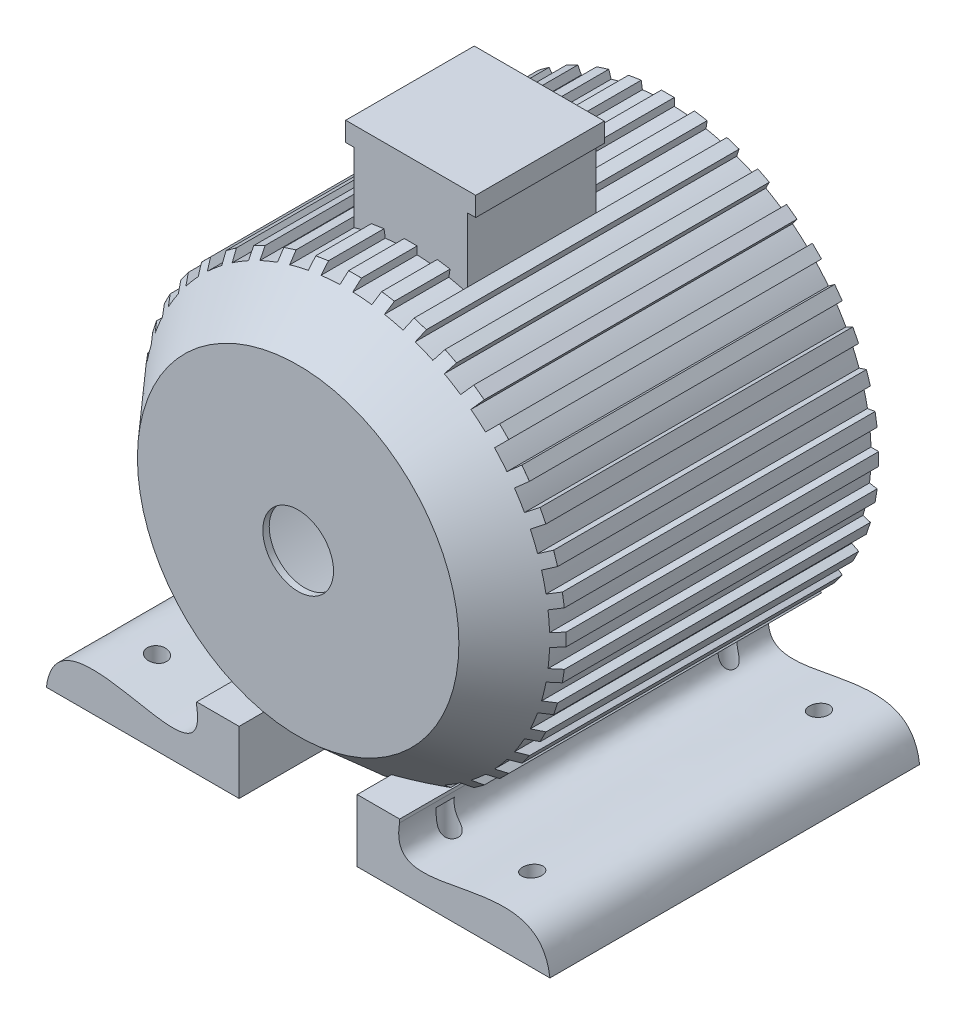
from build123d import *

# Parameters (mm, degrees)
SKETCH2_R           = 55
CUT_EXTRUDE1_DEPTH  = 934
BOSS_EXTRUDE1_DEPTH = 10
BOSS_EXTRUDE2_REACH = 734.755
CIRPATTERN3_COUNT   = 40
BOSS_EXTRUDE5_REACH = 740.81
SKETCH9_R           = 15
CUT_EXTRUDE3_DEPTH  = 83
BOSS_EXTRUDE6_DEPTH = 200


with BuildPart() as part:
    # Sketch1 → Revolve1 (revolve)
    with BuildSketch(Plane(origin=(0, 0, 0), x_dir=(1, 0, 0), z_dir=(0, 1, 0))):
        Polygon((0, 0), (250, 0), (316.097841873, 75.040491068), (316.097841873, 575.040491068), (306.097841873, 575.040491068), (306.097841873, 78.816636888), (245.48215135, 10), (0, 10), align=None)
    revolve(axis=Axis((0, 0, 0), (0, 0, -1)))

    # Sketch2 → Cut-Extrude1 (cut)
    with BuildSketch(Plane.XY):
        Circle(SKETCH2_R)
    extrude(amount=-CUT_EXTRUDE1_DEPTH, mode=Mode.SUBTRACT)

    # Boss-Extrude2: up to this face of the body (flat: up to its plane)
    boss_extrude2_end = Plane(part.part.faces().sort_by_distance((-307.157244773, 0, -575.040491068))[0])
    # Sketch4 → Boss-Extrude2 (add, up to the picked face)
    with BuildSketch(Plane.XY, mode=Mode.PRIVATE) as boss_extrude2_sk1:
        with BuildLine():
            Line((328, 10), (328, -10))
            Line((328, -10), (315.939623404, -10))
            ThreePointArc((315.939623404, -10), (316.097841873, 0), (315.939623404, 10))
            Line((315.939623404, 10), (328, 10))
        make_face()
    boss_extrude2_tool1 = split(extrude(boss_extrude2_sk1.sketch, amount=-BOSS_EXTRUDE2_REACH, mode=Mode.PRIVATE), bisect_by=boss_extrude2_end, keep=Keep.BOTH, mode=Mode.PRIVATE)
    boss_extrude2 = boss_extrude2_tool1.solids().sort_by(Axis((322.022461, 0, 0), (0, 0, -1)))[0]
    add(boss_extrude2)

    # CirPattern3: Boss-Extrude2 ×40 about axis
    cirpattern3_axis = Axis((0, 0, 0), (0, 0, 1))
    for i in range(1, CIRPATTERN3_COUNT):
        add(boss_extrude2.rotate(cirpattern3_axis, i * 360 / CIRPATTERN3_COUNT))


with BuildPart() as body_2:
    # Sketch3 → Boss-Extrude1 (new body)
    with BuildSketch(Plane(origin=(0, 0, 0), x_dir=(1, 0, 0), z_dir=(0, 1, 0))):
        Polygon((-316.097841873, 575.040491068), (-326.097841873, 575.040491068), (-326.097841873, 75.040491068), (-259.128300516, 0), (-250, 0), (-316.097841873, 75.040491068), align=None)
    extrude(amount=BOSS_EXTRUDE1_DEPTH)


with BuildPart() as cut_revolve3_tool:
    # Sketch5 → Cut-Revolve3 (revolve)
    with BuildSketch(Plane(origin=(0, 0, 0), x_dir=(1, 0, 0), z_dir=(0, 1, 0))):
        Polygon((250, 0), (328, 88.552941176), (372.397114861, 88.552941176), (372.397114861, -23.891672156), (250, -35.784369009), align=None)
    revolve(axis=Axis((0, 0, 0), (0, 0, -1)))


with BuildPart() as part_1:
    add(part.part)

    # Cut-Revolve3: cut by cut_revolve3_tool
    add(cut_revolve3_tool.part, mode=Mode.SUBTRACT)

    # Boss-Extrude5: up to this face of the body (flat: up to its plane)
    boss_extrude5_end = Plane(part_1.part.faces().sort_by_distance((321.969811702, -0.722759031, -575.040491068))[0])
    # Sketch8 → Boss-Extrude5 (add, up to the picked face)
    with BuildSketch(Plane.XY, mode=Mode.PRIVATE) as boss_extrude5_sk1:
        with BuildLine():
            Line((91.847008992, -315.036707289), (91.847008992, -379.791815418))
            Line((91.847008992, -379.791815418), (391.638752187, -379.791815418))
            add(Edge.make_bspline(
                [(157.818949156, -287.710234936), (136.098941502, -414.277923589), (372.783888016, -235.115469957), (391.638752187, -379.791815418)],
                knots=[0, 0, 0, 0, 1, 1, 1, 1], degree=3))
            Line((157.818949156, -287.710234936), (157.818949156, -282.562965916))
            Line((157.818949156, -282.562965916), (91.847008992, -282.562965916))
            Line((91.847008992, -282.562965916), (91.847008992, -315.036707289))
        make_face()
    boss_extrude5_tool1 = split(extrude(boss_extrude5_sk1.sketch, amount=-BOSS_EXTRUDE5_REACH, mode=Mode.PRIVATE), bisect_by=boss_extrude5_end, keep=Keep.BOTH, mode=Mode.PRIVATE)
    # Sketch8 → Boss-Extrude5 (add, up to the picked face)
    with BuildSketch(Plane.XY, mode=Mode.PRIVATE) as boss_extrude5_sk2:
        with BuildLine():
            Line((-91.847008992, -282.562965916), (-157.818949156, -282.562965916))
            Line((-157.818949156, -282.562965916), (-157.818949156, -287.710234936))
            add(Edge.make_bspline(
                [(-157.818949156, -287.710234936), (-136.098941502, -414.277923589), (-372.783888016, -235.115469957), (-391.638752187, -379.791815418)],
                knots=[0, 0, 0, 0, 1, 1, 1, 1], degree=3))
            Line((-391.638752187, -379.791815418), (-91.847008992, -379.791815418))
            Line((-91.847008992, -379.791815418), (-91.847008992, -315.036707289))
            Line((-91.847008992, -315.036707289), (-91.847008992, -282.562965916))
        make_face()
    boss_extrude5_tool2 = split(extrude(boss_extrude5_sk2.sketch, amount=-BOSS_EXTRUDE5_REACH, mode=Mode.PRIVATE), bisect_by=boss_extrude5_end, keep=Keep.BOTH, mode=Mode.PRIVATE)
    add(boss_extrude5_tool1.solids().sort_by(Axis((221.70866, -345.870112, 0), (0, 0, -1)))[0])
    add(boss_extrude5_tool2.solids().sort_by(Axis((-221.70866, -345.870112, 0), (0, 0, -1)))[0])

    # Sketch9 → Cut-Extrude3 (cut)
    with BuildSketch(Plane.XZ.offset(379.791815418)):
        with Locations(Location((161.847008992, -72.196769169, 0), (0, 0, 270))):
            Circle(SKETCH9_R)
        with Locations(Location((153.74542507, -511.054036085, 0), (0, 0, 270))):
            Circle(SKETCH9_R)
        with Locations(Location((291.847008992, -72.196769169, 0), (0, 0, 270))):
            Circle(SKETCH9_R)
        with Locations(Location((299.035300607, -511.054036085, 0), (0, 0, 270))):
            Circle(SKETCH9_R)
        with Locations(Location((-153.74542507, -511.054036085, 0), (0, 0, 258.816357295))):
            Circle(SKETCH9_R)
        with Locations(Location((-299.035300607, -511.054036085, 0), (0, 0, 270))):
            Circle(SKETCH9_R)
        with Locations(Location((-291.847008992, -72.196769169, 0), (0, 0, 270))):
            Circle(SKETCH9_R)
        with Locations(Location((-161.847008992, -72.196769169, 0), (0, 0, 290.252091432))):
            Circle(SKETCH9_R)
    extrude(amount=-CUT_EXTRUDE3_DEPTH, mode=Mode.SUBTRACT)

    # Sketch10 → Boss-Extrude6 (add)
    with BuildSketch(Plane(origin=(0, 0, -375.040491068), x_dir=(-1, 0, 0), z_dir=(0, 0, -1))):
        Polygon((88.120147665, 303.566607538), (-88.120147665, 303.566607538), (-88.120147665, 411.741341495), (-101.120147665, 411.741341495), (-101.120147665, 441.741341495), (101.120147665, 441.741341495), (101.120147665, 411.741341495), (88.120147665, 411.741341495), align=None)
    extrude(amount=-BOSS_EXTRUDE6_DEPTH)


with BuildPart() as body_2_1:
    add(body_2.part)

    # Cut-Revolve3: cut by cut_revolve3_tool
    add(cut_revolve3_tool.part, mode=Mode.SUBTRACT)


solid = Compound([part_1.part, body_2_1.part])
